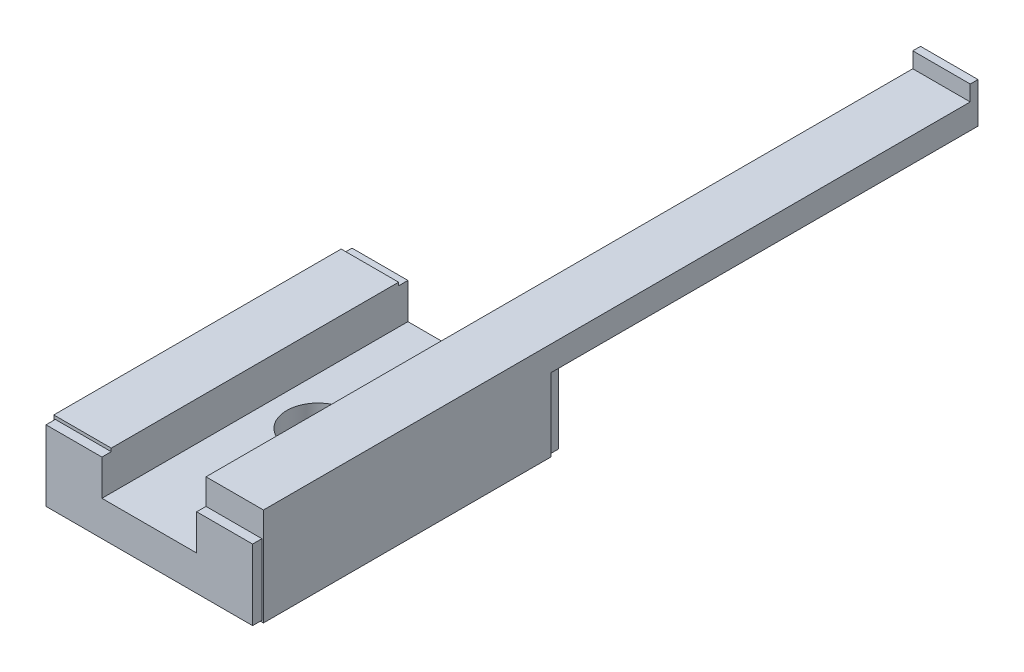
ISO-10303-21;
HEADER;
FILE_DESCRIPTION(('STEP AP214'),'2;1');
FILE_NAME('part.step','',(''),(''),'','','');
FILE_SCHEMA(('AUTOMOTIVE_DESIGN { 1 0 10303 214 1 1 1 1 }'));
ENDSEC;
DATA;
#1=APPLICATION_CONTEXT('core data for automotive mechanical design processes');
#2=APPLICATION_PROTOCOL_DEFINITION('international standard','automotive_design',2000,#1);
#3=PRODUCT_CONTEXT('',#1,'mechanical');
#4=PRODUCT('Part','Part','',(#3));
#5=PRODUCT_RELATED_PRODUCT_CATEGORY('part','',(#4));
#6=PRODUCT_DEFINITION_FORMATION('','',#4);
#7=PRODUCT_DEFINITION_CONTEXT('part definition',#1,'design');
#8=PRODUCT_DEFINITION('design','',#6,#7);
#9=PRODUCT_DEFINITION_SHAPE('','',#8);
#10=(LENGTH_UNIT() NAMED_UNIT(*) SI_UNIT(.MILLI.,.METRE.));
#11=(NAMED_UNIT(*) PLANE_ANGLE_UNIT() SI_UNIT($,.RADIAN.));
#12=(NAMED_UNIT(*) SI_UNIT($,.STERADIAN.) SOLID_ANGLE_UNIT());
#13=UNCERTAINTY_MEASURE_WITH_UNIT(LENGTH_MEASURE(1.E-05),#10,'distance_accuracy_value','');
#14=(GEOMETRIC_REPRESENTATION_CONTEXT(3) GLOBAL_UNCERTAINTY_ASSIGNED_CONTEXT((#13)) GLOBAL_UNIT_ASSIGNED_CONTEXT((#10,
#11,#12)) REPRESENTATION_CONTEXT('',''));
#15=CARTESIAN_POINT('',(0.,0.,0.));
#16=DIRECTION('',(0.,0.,1.));
#17=DIRECTION('',(1.,0.,0.));
#18=AXIS2_PLACEMENT_3D('',#15,#16,#17);
#19=CARTESIAN_POINT('',(6.1,12.6,38.2));
#20=DIRECTION('',(0.,1.,0.));
#21=DIRECTION('',(1.,0.,0.));
#22=AXIS2_PLACEMENT_3D('',#19,#20,#21);
#23=PLANE('',#22);
#24=DIRECTION('',(-1.,0.,0.));
#25=VECTOR('',#24,1.);
#26=CARTESIAN_POINT('',(13.5,12.6,-52.8));
#27=LINE('',#26,#25);
#28=CARTESIAN_POINT('',(6.1,12.6,-52.8));
#29=VERTEX_POINT('',#28);
#30=CARTESIAN_POINT('',(13.5,12.6,-52.8));
#31=VERTEX_POINT('',#30);
#32=EDGE_CURVE('E197',#29,#31,#27,.F.);
#33=ORIENTED_EDGE('',*,*,#32,.F.);
#34=DIRECTION('',(0.,0.,1.));
#35=VECTOR('',#34,1.);
#36=CARTESIAN_POINT('',(6.1,12.6,-52.8));
#37=LINE('',#36,#35);
#38=CARTESIAN_POINT('',(6.1,12.6,38.2));
#39=VERTEX_POINT('',#38);
#40=EDGE_CURVE('E212',#39,#29,#37,.F.);
#41=ORIENTED_EDGE('',*,*,#40,.F.);
#42=DIRECTION('',(1.,0.,0.));
#43=VECTOR('',#42,1.);
#44=CARTESIAN_POINT('',(6.1,12.6,38.2));
#45=LINE('',#44,#43);
#46=CARTESIAN_POINT('',(13.5,12.6,38.2));
#47=VERTEX_POINT('',#46);
#48=EDGE_CURVE('E221',#47,#39,#45,.F.);
#49=ORIENTED_EDGE('',*,*,#48,.F.);
#50=DIRECTION('',(0.,0.,-1.));
#51=VECTOR('',#50,1.);
#52=CARTESIAN_POINT('',(13.5,12.6,38.2));
#53=LINE('',#52,#51);
#54=EDGE_CURVE('E214',#47,#31,#53,.T.);
#55=ORIENTED_EDGE('',*,*,#54,.T.);
#56=EDGE_LOOP('',(#33,#41,#49,#55));
#57=FACE_BOUND('',#56,.T.);
#58=ADVANCED_FACE('F16',(#57),#23,.T.);
#59=CARTESIAN_POINT('',(-13.5,9.7,38.2));
#60=DIRECTION('',(0.,1.,0.));
#61=DIRECTION('',(1.,0.,0.));
#62=AXIS2_PLACEMENT_3D('',#59,#60,#61);
#63=PLANE('',#62);
#64=DIRECTION('',(1.,0.,0.));
#65=VECTOR('',#64,1.);
#66=CARTESIAN_POINT('',(-13.5,9.7,38.2));
#67=LINE('',#66,#65);
#68=CARTESIAN_POINT('',(-6.1,9.7,38.2));
#69=VERTEX_POINT('',#68);
#70=CARTESIAN_POINT('',(-13.5,9.7,38.2));
#71=VERTEX_POINT('',#70);
#72=EDGE_CURVE('E232',#69,#71,#67,.F.);
#73=ORIENTED_EDGE('',*,*,#72,.F.);
#74=DIRECTION('',(0.,0.,-1.));
#75=VECTOR('',#74,1.);
#76=CARTESIAN_POINT('',(-6.1,9.7,38.2));
#77=LINE('',#76,#75);
#78=CARTESIAN_POINT('',(-6.1,9.7,1.2));
#79=VERTEX_POINT('',#78);
#80=EDGE_CURVE('E236',#69,#79,#77,.T.);
#81=ORIENTED_EDGE('',*,*,#80,.T.);
#82=DIRECTION('',(-1.,0.,0.));
#83=VECTOR('',#82,1.);
#84=CARTESIAN_POINT('',(-6.1,9.7,1.2));
#85=LINE('',#84,#83);
#86=CARTESIAN_POINT('',(-13.5,9.7,1.2));
#87=VERTEX_POINT('',#86);
#88=EDGE_CURVE('E241',#79,#87,#85,.T.);
#89=ORIENTED_EDGE('',*,*,#88,.T.);
#90=DIRECTION('',(0.,0.,1.));
#91=VECTOR('',#90,1.);
#92=CARTESIAN_POINT('',(-13.5,9.7,1.2));
#93=LINE('',#92,#91);
#94=EDGE_CURVE('E246',#71,#87,#93,.F.);
#95=ORIENTED_EDGE('',*,*,#94,.F.);
#96=EDGE_LOOP('',(#73,#81,#89,#95));
#97=FACE_BOUND('',#96,.T.);
#98=ADVANCED_FACE('F638',(#97),#63,.T.);
#99=CARTESIAN_POINT('',(-13.5,0.,38.2));
#100=DIRECTION('',(-1.,0.,0.));
#101=DIRECTION('',(0.,1.,0.));
#102=AXIS2_PLACEMENT_3D('',#99,#100,#101);
#103=PLANE('',#102);
#104=DIRECTION('',(0.,1.,0.));
#105=VECTOR('',#104,1.);
#106=CARTESIAN_POINT('',(-13.5,0.,38.2));
#107=LINE('',#106,#105);
#108=CARTESIAN_POINT('',(-13.5,0.,38.2));
#109=VERTEX_POINT('',#108);
#110=EDGE_CURVE('E251',#71,#109,#107,.F.);
#111=ORIENTED_EDGE('',*,*,#110,.F.);
#112=ORIENTED_EDGE('',*,*,#94,.T.);
#113=DIRECTION('',(0.,-1.,0.));
#114=VECTOR('',#113,1.);
#115=CARTESIAN_POINT('',(-13.5,9.7,1.2));
#116=LINE('',#115,#114);
#117=CARTESIAN_POINT('',(-13.5,0.,1.2));
#118=VERTEX_POINT('',#117);
#119=EDGE_CURVE('E255',#87,#118,#116,.T.);
#120=ORIENTED_EDGE('',*,*,#119,.T.);
#121=DIRECTION('',(0.,0.,1.));
#122=VECTOR('',#121,1.);
#123=CARTESIAN_POINT('',(-13.5,0.,1.2));
#124=LINE('',#123,#122);
#125=EDGE_CURVE('E260',#109,#118,#124,.F.);
#126=ORIENTED_EDGE('',*,*,#125,.F.);
#127=EDGE_LOOP('',(#111,#112,#120,#126));
#128=FACE_BOUND('',#127,.T.);
#129=ADVANCED_FACE('F643',(#128),#103,.T.);
#130=CARTESIAN_POINT('',(-13.5,0.,1.2));
#131=DIRECTION('',(0.,-1.,0.));
#132=DIRECTION('',(1.,0.,0.));
#133=AXIS2_PLACEMENT_3D('',#130,#131,#132);
#134=PLANE('',#133);
#135=DIRECTION('',(-1.,0.,0.));
#136=VECTOR('',#135,1.);
#137=CARTESIAN_POINT('',(-6.4,0.,38.2));
#138=LINE('',#137,#136);
#139=CARTESIAN_POINT('',(-6.4,0.,38.2));
#140=VERTEX_POINT('',#139);
#141=EDGE_CURVE('E265',#109,#140,#138,.F.);
#142=ORIENTED_EDGE('',*,*,#141,.F.);
#143=ORIENTED_EDGE('',*,*,#125,.T.);
#144=DIRECTION('',(1.,0.,0.));
#145=VECTOR('',#144,1.);
#146=CARTESIAN_POINT('',(-13.5,0.,1.2));
#147=LINE('',#146,#145);
#148=CARTESIAN_POINT('',(-6.4,0.,1.2));
#149=VERTEX_POINT('',#148);
#150=EDGE_CURVE('E269',#118,#149,#147,.T.);
#151=ORIENTED_EDGE('',*,*,#150,.T.);
#152=DIRECTION('',(0.,0.,1.));
#153=VECTOR('',#152,1.);
#154=CARTESIAN_POINT('',(-6.4,0.,1.2));
#155=LINE('',#154,#153);
#156=EDGE_CURVE('E274',#140,#149,#155,.F.);
#157=ORIENTED_EDGE('',*,*,#156,.F.);
#158=EDGE_LOOP('',(#142,#143,#151,#157));
#159=FACE_BOUND('',#158,.T.);
#160=CARTESIAN_POINT('',(-10.,0.,6.7));
#161=DIRECTION('',(0.,1.,0.));
#162=DIRECTION('',(0.,0.,-1.));
#163=AXIS2_PLACEMENT_3D('',#160,#161,#162);
#164=CIRCLE('',#163,2.);
#165=CARTESIAN_POINT('',(-10.,0.,4.7));
#166=VERTEX_POINT('',#165);
#167=EDGE_CURVE('E279',#166,#166,#164,.F.);
#168=ORIENTED_EDGE('',*,*,#167,.F.);
#169=EDGE_LOOP('',(#168));
#170=FACE_BOUND('',#169,.T.);
#171=CARTESIAN_POINT('',(-10.,0.,32.7));
#172=DIRECTION('',(0.,1.,0.));
#173=DIRECTION('',(0.,0.,-1.));
#174=AXIS2_PLACEMENT_3D('',#171,#172,#173);
#175=CIRCLE('',#174,2.);
#176=CARTESIAN_POINT('',(-10.,0.,30.7));
#177=VERTEX_POINT('',#176);
#178=EDGE_CURVE('E284',#177,#177,#175,.F.);
#179=ORIENTED_EDGE('',*,*,#178,.F.);
#180=EDGE_LOOP('',(#179));
#181=FACE_BOUND('',#180,.T.);
#182=ADVANCED_FACE('F649',(#159,#170,#181),#134,.T.);
#183=CARTESIAN_POINT('',(-6.2,0.200000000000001,1.2));
#184=DIRECTION('',(0.707106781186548,-0.707106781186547,0.));
#185=DIRECTION('',(0.,0.,1.));
#186=AXIS2_PLACEMENT_3D('',#183,#184,#185);
#187=PLANE('',#186);
#188=DIRECTION('',(-0.707106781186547,-0.707106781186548,0.));
#189=VECTOR('',#188,1.);
#190=CARTESIAN_POINT('',(-6.2,0.200000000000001,38.2));
#191=LINE('',#190,#189);
#192=CARTESIAN_POINT('',(-6.2,0.200000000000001,38.2));
#193=VERTEX_POINT('',#192);
#194=EDGE_CURVE('E287',#140,#193,#191,.F.);
#195=ORIENTED_EDGE('',*,*,#194,.F.);
#196=ORIENTED_EDGE('',*,*,#156,.T.);
#197=DIRECTION('',(0.707106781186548,0.707106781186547,0.));
#198=VECTOR('',#197,1.);
#199=CARTESIAN_POINT('',(-6.4,0.,1.2));
#200=LINE('',#199,#198);
#201=CARTESIAN_POINT('',(-6.2,0.200000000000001,1.2));
#202=VERTEX_POINT('',#201);
#203=EDGE_CURVE('E289',#149,#202,#200,.T.);
#204=ORIENTED_EDGE('',*,*,#203,.T.);
#205=DIRECTION('',(0.,0.,1.));
#206=VECTOR('',#205,1.);
#207=CARTESIAN_POINT('',(-6.2,0.2,1.2));
#208=LINE('',#207,#206);
#209=EDGE_CURVE('E294',#193,#202,#208,.F.);
#210=ORIENTED_EDGE('',*,*,#209,.F.);
#211=EDGE_LOOP('',(#195,#196,#204,#210));
#212=FACE_BOUND('',#211,.T.);
#213=ADVANCED_FACE('F653',(#212),#187,.T.);
#214=CARTESIAN_POINT('',(6.4,0.,1.2));
#215=DIRECTION('',(-0.707106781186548,-0.707106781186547,0.));
#216=DIRECTION('',(0.,0.,1.));
#217=AXIS2_PLACEMENT_3D('',#214,#215,#216);
#218=PLANE('',#217);
#219=DIRECTION('',(-0.707106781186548,0.707106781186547,0.));
#220=VECTOR('',#219,1.);
#221=CARTESIAN_POINT('',(6.4,0.,38.2));
#222=LINE('',#221,#220);
#223=CARTESIAN_POINT('',(6.2,0.2,38.2));
#224=VERTEX_POINT('',#223);
#225=CARTESIAN_POINT('',(6.4,0.,38.2));
#226=VERTEX_POINT('',#225);
#227=EDGE_CURVE('E299',#224,#226,#222,.F.);
#228=ORIENTED_EDGE('',*,*,#227,.F.);
#229=DIRECTION('',(0.,0.,-1.));
#230=VECTOR('',#229,1.);
#231=CARTESIAN_POINT('',(6.2,0.2,38.2));
#232=LINE('',#231,#230);
#233=CARTESIAN_POINT('',(6.2,0.199999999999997,1.2));
#234=VERTEX_POINT('',#233);
#235=EDGE_CURVE('E303',#224,#234,#232,.T.);
#236=ORIENTED_EDGE('',*,*,#235,.T.);
#237=DIRECTION('',(0.707106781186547,-0.707106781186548,0.));
#238=VECTOR('',#237,1.);
#239=CARTESIAN_POINT('',(6.2,0.199999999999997,1.2));
#240=LINE('',#239,#238);
#241=CARTESIAN_POINT('',(6.4,0.,1.2));
#242=VERTEX_POINT('',#241);
#243=EDGE_CURVE('E308',#234,#242,#240,.T.);
#244=ORIENTED_EDGE('',*,*,#243,.T.);
#245=DIRECTION('',(0.,0.,1.));
#246=VECTOR('',#245,1.);
#247=CARTESIAN_POINT('',(6.4,0.,1.2));
#248=LINE('',#247,#246);
#249=EDGE_CURVE('E313',#226,#242,#248,.F.);
#250=ORIENTED_EDGE('',*,*,#249,.F.);
#251=EDGE_LOOP('',(#228,#236,#244,#250));
#252=FACE_BOUND('',#251,.T.);
#253=ADVANCED_FACE('F657',(#252),#218,.T.);
#254=CARTESIAN_POINT('',(6.4,0.,1.2));
#255=DIRECTION('',(0.,-1.,0.));
#256=DIRECTION('',(1.,0.,0.));
#257=AXIS2_PLACEMENT_3D('',#254,#255,#256);
#258=PLANE('',#257);
#259=DIRECTION('',(-1.,0.,0.));
#260=VECTOR('',#259,1.);
#261=CARTESIAN_POINT('',(13.5,0.,38.2));
#262=LINE('',#261,#260);
#263=CARTESIAN_POINT('',(13.5,0.,38.2));
#264=VERTEX_POINT('',#263);
#265=EDGE_CURVE('E318',#226,#264,#262,.F.);
#266=ORIENTED_EDGE('',*,*,#265,.F.);
#267=ORIENTED_EDGE('',*,*,#249,.T.);
#268=DIRECTION('',(1.,0.,0.));
#269=VECTOR('',#268,1.);
#270=CARTESIAN_POINT('',(6.4,0.,1.2));
#271=LINE('',#270,#269);
#272=CARTESIAN_POINT('',(13.5,0.,1.2));
#273=VERTEX_POINT('',#272);
#274=EDGE_CURVE('E322',#242,#273,#271,.T.);
#275=ORIENTED_EDGE('',*,*,#274,.T.);
#276=DIRECTION('',(0.,0.,1.));
#277=VECTOR('',#276,1.);
#278=CARTESIAN_POINT('',(13.5,0.,1.2));
#279=LINE('',#278,#277);
#280=EDGE_CURVE('E327',#264,#273,#279,.F.);
#281=ORIENTED_EDGE('',*,*,#280,.F.);
#282=EDGE_LOOP('',(#266,#267,#275,#281));
#283=FACE_BOUND('',#282,.T.);
#284=CARTESIAN_POINT('',(10.,0.,6.7));
#285=DIRECTION('',(0.,1.,0.));
#286=DIRECTION('',(0.,0.,-1.));
#287=AXIS2_PLACEMENT_3D('',#284,#285,#286);
#288=CIRCLE('',#287,2.);
#289=CARTESIAN_POINT('',(10.,0.,4.7));
#290=VERTEX_POINT('',#289);
#291=EDGE_CURVE('E332',#290,#290,#288,.F.);
#292=ORIENTED_EDGE('',*,*,#291,.F.);
#293=EDGE_LOOP('',(#292));
#294=FACE_BOUND('',#293,.T.);
#295=CARTESIAN_POINT('',(10.,0.,32.7));
#296=DIRECTION('',(0.,1.,0.));
#297=DIRECTION('',(0.,0.,-1.));
#298=AXIS2_PLACEMENT_3D('',#295,#296,#297);
#299=CIRCLE('',#298,2.);
#300=CARTESIAN_POINT('',(10.,0.,30.7));
#301=VERTEX_POINT('',#300);
#302=EDGE_CURVE('E337',#301,#301,#299,.F.);
#303=ORIENTED_EDGE('',*,*,#302,.F.);
#304=EDGE_LOOP('',(#303));
#305=FACE_BOUND('',#304,.T.);
#306=ADVANCED_FACE('F661',(#283,#294,#305),#258,.T.);
#307=CARTESIAN_POINT('',(13.5,0.,-53.8));
#308=DIRECTION('',(1.,0.,0.));
#309=DIRECTION('',(0.,1.,0.));
#310=AXIS2_PLACEMENT_3D('',#307,#308,#309);
#311=PLANE('',#310);
#312=DIRECTION('',(0.,-1.,0.));
#313=VECTOR('',#312,1.);
#314=CARTESIAN_POINT('',(13.5,12.6,38.2));
#315=LINE('',#314,#313);
#316=EDGE_CURVE('E340',#264,#47,#315,.F.);
#317=ORIENTED_EDGE('',*,*,#316,.F.);
#318=ORIENTED_EDGE('',*,*,#280,.T.);
#319=DIRECTION('',(0.,1.,0.));
#320=VECTOR('',#319,1.);
#321=CARTESIAN_POINT('',(13.5,0.,1.2));
#322=LINE('',#321,#320);
#323=CARTESIAN_POINT('',(13.5,9.4,1.2));
#324=VERTEX_POINT('',#323);
#325=EDGE_CURVE('E342',#273,#324,#322,.T.);
#326=ORIENTED_EDGE('',*,*,#325,.T.);
#327=DIRECTION('',(0.,0.,-1.));
#328=VECTOR('',#327,1.);
#329=CARTESIAN_POINT('',(13.5,9.4,1.2));
#330=LINE('',#329,#328);
#331=CARTESIAN_POINT('',(13.5,9.4,-53.8));
#332=VERTEX_POINT('',#331);
#333=EDGE_CURVE('E347',#332,#324,#330,.F.);
#334=ORIENTED_EDGE('',*,*,#333,.F.);
#335=DIRECTION('',(0.,1.,0.));
#336=VECTOR('',#335,1.);
#337=CARTESIAN_POINT('',(13.5,9.4,-53.8));
#338=LINE('',#337,#336);
#339=CARTESIAN_POINT('',(13.5,14.6,-53.8));
#340=VERTEX_POINT('',#339);
#341=EDGE_CURVE('E351',#332,#340,#338,.T.);
#342=ORIENTED_EDGE('',*,*,#341,.T.);
#343=DIRECTION('',(0.,0.,1.));
#344=VECTOR('',#343,1.);
#345=CARTESIAN_POINT('',(13.5,14.6,-53.8));
#346=LINE('',#345,#344);
#347=CARTESIAN_POINT('',(13.5,14.6,-52.8));
#348=VERTEX_POINT('',#347);
#349=EDGE_CURVE('E356',#348,#340,#346,.F.);
#350=ORIENTED_EDGE('',*,*,#349,.F.);
#351=DIRECTION('',(0.,-1.,0.));
#352=VECTOR('',#351,1.);
#353=CARTESIAN_POINT('',(13.5,14.6,-52.8));
#354=LINE('',#353,#352);
#355=EDGE_CURVE('E360',#31,#348,#354,.F.);
#356=ORIENTED_EDGE('',*,*,#355,.F.);
#357=ORIENTED_EDGE('',*,*,#54,.F.);
#358=EDGE_LOOP('',(#317,#318,#326,#334,#342,#350,#356,#357));
#359=FACE_BOUND('',#358,.T.);
#360=ADVANCED_FACE('F665',(#359),#311,.T.);
#361=CARTESIAN_POINT('',(6.1,4.7,39.4));
#362=DIRECTION('',(-1.,0.,0.));
#363=DIRECTION('',(0.,1.,0.));
#364=AXIS2_PLACEMENT_3D('',#361,#362,#363);
#365=PLANE('',#364);
#366=DIRECTION('',(0.,0.,1.));
#367=VECTOR('',#366,1.);
#368=CARTESIAN_POINT('',(6.1,9.4,-53.8));
#369=LINE('',#368,#367);
#370=CARTESIAN_POINT('',(6.1,9.4,-53.8));
#371=VERTEX_POINT('',#370);
#372=CARTESIAN_POINT('',(6.1,9.4,0.));
#373=VERTEX_POINT('',#372);
#374=EDGE_CURVE('E364',#371,#373,#369,.T.);
#375=ORIENTED_EDGE('',*,*,#374,.T.);
#376=DIRECTION('',(0.,-1.,0.));
#377=VECTOR('',#376,1.);
#378=CARTESIAN_POINT('',(6.1,9.4,0.));
#379=LINE('',#378,#377);
#380=CARTESIAN_POINT('',(6.1,4.7,0.));
#381=VERTEX_POINT('',#380);
#382=EDGE_CURVE('E368',#373,#381,#379,.T.);
#383=ORIENTED_EDGE('',*,*,#382,.T.);
#384=DIRECTION('',(0.,0.,1.));
#385=VECTOR('',#384,1.);
#386=CARTESIAN_POINT('',(6.1,4.7,0.));
#387=LINE('',#386,#385);
#388=CARTESIAN_POINT('',(6.1,4.7,39.4));
#389=VERTEX_POINT('',#388);
#390=EDGE_CURVE('E373',#389,#381,#387,.F.);
#391=ORIENTED_EDGE('',*,*,#390,.F.);
#392=DIRECTION('',(0.,1.,0.));
#393=VECTOR('',#392,1.);
#394=CARTESIAN_POINT('',(6.1,4.7,39.4));
#395=LINE('',#394,#393);
#396=CARTESIAN_POINT('',(6.1,9.3,39.4));
#397=VERTEX_POINT('',#396);
#398=EDGE_CURVE('E377',#397,#389,#395,.F.);
#399=ORIENTED_EDGE('',*,*,#398,.F.);
#400=DIRECTION('',(0.,0.,-1.));
#401=VECTOR('',#400,1.);
#402=CARTESIAN_POINT('',(6.1,9.3,39.4));
#403=LINE('',#402,#401);
#404=CARTESIAN_POINT('',(6.1,9.3,38.2));
#405=VERTEX_POINT('',#404);
#406=EDGE_CURVE('E381',#405,#397,#403,.F.);
#407=ORIENTED_EDGE('',*,*,#406,.F.);
#408=DIRECTION('',(0.,1.,0.));
#409=VECTOR('',#408,1.);
#410=CARTESIAN_POINT('',(6.1,9.3,38.2));
#411=LINE('',#410,#409);
#412=EDGE_CURVE('E206',#39,#405,#411,.F.);
#413=ORIENTED_EDGE('',*,*,#412,.F.);
#414=ORIENTED_EDGE('',*,*,#40,.T.);
#415=DIRECTION('',(0.,1.,0.));
#416=VECTOR('',#415,1.);
#417=CARTESIAN_POINT('',(6.1,12.6,-52.8));
#418=LINE('',#417,#416);
#419=CARTESIAN_POINT('',(6.1,14.6,-52.8));
#420=VERTEX_POINT('',#419);
#421=EDGE_CURVE('E194',#420,#29,#418,.F.);
#422=ORIENTED_EDGE('',*,*,#421,.F.);
#423=DIRECTION('',(0.,0.,-1.));
#424=VECTOR('',#423,1.);
#425=CARTESIAN_POINT('',(6.1,14.6,-52.8));
#426=LINE('',#425,#424);
#427=CARTESIAN_POINT('',(6.1,14.6,-53.8));
#428=VERTEX_POINT('',#427);
#429=EDGE_CURVE('E205',#420,#428,#426,.T.);
#430=ORIENTED_EDGE('',*,*,#429,.T.);
#431=DIRECTION('',(0.,-1.,0.));
#432=VECTOR('',#431,1.);
#433=CARTESIAN_POINT('',(6.1,14.6,-53.8));
#434=LINE('',#433,#432);
#435=EDGE_CURVE('E393',#428,#371,#434,.T.);
#436=ORIENTED_EDGE('',*,*,#435,.T.);
#437=EDGE_LOOP('',(#375,#383,#391,#399,#407,#413,#414,#422,#430,#436));
#438=FACE_BOUND('',#437,.T.);
#439=ADVANCED_FACE('F218',(#438),#365,.T.);
#440=CARTESIAN_POINT('',(-6.1,4.7,0.));
#441=DIRECTION('',(1.,0.,0.));
#442=DIRECTION('',(0.,1.,0.));
#443=AXIS2_PLACEMENT_3D('',#440,#441,#442);
#444=PLANE('',#443);
#445=DIRECTION('',(0.,-1.,0.));
#446=VECTOR('',#445,1.);
#447=CARTESIAN_POINT('',(-6.1,9.7,38.2));
#448=LINE('',#447,#446);
#449=CARTESIAN_POINT('',(-6.1,9.3,38.2));
#450=VERTEX_POINT('',#449);
#451=EDGE_CURVE('E398',#450,#69,#448,.F.);
#452=ORIENTED_EDGE('',*,*,#451,.F.);
#453=DIRECTION('',(0.,0.,1.));
#454=VECTOR('',#453,1.);
#455=CARTESIAN_POINT('',(-6.1,9.3,38.2));
#456=LINE('',#455,#454);
#457=CARTESIAN_POINT('',(-6.1,9.3,39.4));
#458=VERTEX_POINT('',#457);
#459=EDGE_CURVE('E402',#450,#458,#456,.T.);
#460=ORIENTED_EDGE('',*,*,#459,.T.);
#461=DIRECTION('',(0.,-1.,0.));
#462=VECTOR('',#461,1.);
#463=CARTESIAN_POINT('',(-6.1,9.3,39.4));
#464=LINE('',#463,#462);
#465=CARTESIAN_POINT('',(-6.1,4.7,39.4));
#466=VERTEX_POINT('',#465);
#467=EDGE_CURVE('E407',#466,#458,#464,.F.);
#468=ORIENTED_EDGE('',*,*,#467,.F.);
#469=DIRECTION('',(0.,0.,-1.));
#470=VECTOR('',#469,1.);
#471=CARTESIAN_POINT('',(-6.1,4.7,39.4));
#472=LINE('',#471,#470);
#473=CARTESIAN_POINT('',(-6.1,4.7,0.));
#474=VERTEX_POINT('',#473);
#475=EDGE_CURVE('E412',#466,#474,#472,.T.);
#476=ORIENTED_EDGE('',*,*,#475,.T.);
#477=DIRECTION('',(0.,1.,0.));
#478=VECTOR('',#477,1.);
#479=CARTESIAN_POINT('',(-6.1,4.7,0.));
#480=LINE('',#479,#478);
#481=CARTESIAN_POINT('',(-6.1,9.3,0.));
#482=VERTEX_POINT('',#481);
#483=EDGE_CURVE('E417',#474,#482,#480,.T.);
#484=ORIENTED_EDGE('',*,*,#483,.T.);
#485=DIRECTION('',(0.,0.,1.));
#486=VECTOR('',#485,1.);
#487=CARTESIAN_POINT('',(-6.1,9.3,0.));
#488=LINE('',#487,#486);
#489=CARTESIAN_POINT('',(-6.1,9.3,1.2));
#490=VERTEX_POINT('',#489);
#491=EDGE_CURVE('E422',#490,#482,#488,.F.);
#492=ORIENTED_EDGE('',*,*,#491,.F.);
#493=DIRECTION('',(0.,1.,0.));
#494=VECTOR('',#493,1.);
#495=CARTESIAN_POINT('',(-6.1,9.3,1.2));
#496=LINE('',#495,#494);
#497=EDGE_CURVE('E426',#490,#79,#496,.T.);
#498=ORIENTED_EDGE('',*,*,#497,.T.);
#499=ORIENTED_EDGE('',*,*,#80,.F.);
#500=EDGE_LOOP('',(#452,#460,#468,#476,#484,#492,#498,#499));
#501=FACE_BOUND('',#500,.T.);
#502=ADVANCED_FACE('F672',(#501),#444,.T.);
#503=CARTESIAN_POINT('',(-13.3,0.199999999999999,0.));
#504=DIRECTION('',(0.,0.,-1.));
#505=DIRECTION('',(0.,1.,0.));
#506=AXIS2_PLACEMENT_3D('',#503,#504,#505);
#507=PLANE('',#506);
#508=ORIENTED_EDGE('',*,*,#382,.F.);
#509=DIRECTION('',(1.,0.,0.));
#510=VECTOR('',#509,1.);
#511=CARTESIAN_POINT('',(6.1,9.4,0.));
#512=LINE('',#511,#510);
#513=CARTESIAN_POINT('',(13.3,9.4,0.));
#514=VERTEX_POINT('',#513);
#515=EDGE_CURVE('E431',#373,#514,#512,.T.);
#516=ORIENTED_EDGE('',*,*,#515,.T.);
#517=DIRECTION('',(0.,-1.,0.));
#518=VECTOR('',#517,1.);
#519=CARTESIAN_POINT('',(13.3,9.4,0.));
#520=LINE('',#519,#518);
#521=CARTESIAN_POINT('',(13.3,0.199999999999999,0.));
#522=VERTEX_POINT('',#521);
#523=EDGE_CURVE('E436',#514,#522,#520,.T.);
#524=ORIENTED_EDGE('',*,*,#523,.T.);
#525=DIRECTION('',(-1.,0.,0.));
#526=VECTOR('',#525,1.);
#527=CARTESIAN_POINT('',(13.3,0.2,0.));
#528=LINE('',#527,#526);
#529=CARTESIAN_POINT('',(-13.3,0.2,0.));
#530=VERTEX_POINT('',#529);
#531=EDGE_CURVE('E441',#530,#522,#528,.F.);
#532=ORIENTED_EDGE('',*,*,#531,.F.);
#533=DIRECTION('',(0.,1.,0.));
#534=VECTOR('',#533,1.);
#535=CARTESIAN_POINT('',(-13.3,0.2,0.));
#536=LINE('',#535,#534);
#537=CARTESIAN_POINT('',(-13.3,9.3,0.));
#538=VERTEX_POINT('',#537);
#539=EDGE_CURVE('E446',#530,#538,#536,.T.);
#540=ORIENTED_EDGE('',*,*,#539,.T.);
#541=DIRECTION('',(1.,0.,0.));
#542=VECTOR('',#541,1.);
#543=CARTESIAN_POINT('',(-13.3,9.3,0.));
#544=LINE('',#543,#542);
#545=EDGE_CURVE('E451',#538,#482,#544,.T.);
#546=ORIENTED_EDGE('',*,*,#545,.T.);
#547=ORIENTED_EDGE('',*,*,#483,.F.);
#548=DIRECTION('',(1.,0.,0.));
#549=VECTOR('',#548,1.);
#550=CARTESIAN_POINT('',(-6.1,4.7,0.));
#551=LINE('',#550,#549);
#552=EDGE_CURVE('E456',#381,#474,#551,.F.);
#553=ORIENTED_EDGE('',*,*,#552,.F.);
#554=EDGE_LOOP('',(#508,#516,#524,#532,#540,#546,#547,#553));
#555=FACE_BOUND('',#554,.T.);
#556=ADVANCED_FACE('F675',(#555),#507,.T.);
#557=CARTESIAN_POINT('',(-13.3,0.2,0.));
#558=DIRECTION('',(0.,-1.,0.));
#559=DIRECTION('',(1.,0.,0.));
#560=AXIS2_PLACEMENT_3D('',#557,#558,#559);
#561=PLANE('',#560);
#562=DIRECTION('',(-1.,0.,0.));
#563=VECTOR('',#562,1.);
#564=CARTESIAN_POINT('',(13.3,0.2,39.4));
#565=LINE('',#564,#563);
#566=CARTESIAN_POINT('',(-13.3,0.2,39.4));
#567=VERTEX_POINT('',#566);
#568=CARTESIAN_POINT('',(13.3,0.2,39.4));
#569=VERTEX_POINT('',#568);
#570=EDGE_CURVE('E460',#567,#569,#565,.F.);
#571=ORIENTED_EDGE('',*,*,#570,.F.);
#572=DIRECTION('',(0.,0.,-1.));
#573=VECTOR('',#572,1.);
#574=CARTESIAN_POINT('',(-13.3,0.2,39.4));
#575=LINE('',#574,#573);
#576=CARTESIAN_POINT('',(-13.3,0.2,38.2));
#577=VERTEX_POINT('',#576);
#578=EDGE_CURVE('E465',#577,#567,#575,.F.);
#579=ORIENTED_EDGE('',*,*,#578,.F.);
#580=DIRECTION('',(1.,0.,0.));
#581=VECTOR('',#580,1.);
#582=CARTESIAN_POINT('',(-13.3,0.2,38.2));
#583=LINE('',#582,#581);
#584=EDGE_CURVE('E469',#193,#577,#583,.F.);
#585=ORIENTED_EDGE('',*,*,#584,.F.);
#586=ORIENTED_EDGE('',*,*,#209,.T.);
#587=DIRECTION('',(-1.,0.,0.));
#588=VECTOR('',#587,1.);
#589=CARTESIAN_POINT('',(-6.2,0.2,1.2));
#590=LINE('',#589,#588);
#591=CARTESIAN_POINT('',(-13.3,0.2,1.2));
#592=VERTEX_POINT('',#591);
#593=EDGE_CURVE('E473',#202,#592,#590,.T.);
#594=ORIENTED_EDGE('',*,*,#593,.T.);
#595=DIRECTION('',(0.,0.,-1.));
#596=VECTOR('',#595,1.);
#597=CARTESIAN_POINT('',(-13.3,0.2,1.2));
#598=LINE('',#597,#596);
#599=EDGE_CURVE('E478',#592,#530,#598,.T.);
#600=ORIENTED_EDGE('',*,*,#599,.T.);
#601=ORIENTED_EDGE('',*,*,#531,.T.);
#602=DIRECTION('',(0.,0.,1.));
#603=VECTOR('',#602,1.);
#604=CARTESIAN_POINT('',(13.3,0.2,0.));
#605=LINE('',#604,#603);
#606=CARTESIAN_POINT('',(13.3,0.2,1.2));
#607=VERTEX_POINT('',#606);
#608=EDGE_CURVE('E483',#607,#522,#605,.F.);
#609=ORIENTED_EDGE('',*,*,#608,.F.);
#610=DIRECTION('',(-1.,0.,0.));
#611=VECTOR('',#610,1.);
#612=CARTESIAN_POINT('',(13.3,0.2,1.2));
#613=LINE('',#612,#611);
#614=EDGE_CURVE('E487',#607,#234,#613,.T.);
#615=ORIENTED_EDGE('',*,*,#614,.T.);
#616=ORIENTED_EDGE('',*,*,#235,.F.);
#617=DIRECTION('',(1.,0.,0.));
#618=VECTOR('',#617,1.);
#619=CARTESIAN_POINT('',(6.20000000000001,0.2,38.2));
#620=LINE('',#619,#618);
#621=CARTESIAN_POINT('',(13.3,0.2,38.2));
#622=VERTEX_POINT('',#621);
#623=EDGE_CURVE('E492',#622,#224,#620,.F.);
#624=ORIENTED_EDGE('',*,*,#623,.F.);
#625=DIRECTION('',(0.,0.,1.));
#626=VECTOR('',#625,1.);
#627=CARTESIAN_POINT('',(13.3,0.2,38.2));
#628=LINE('',#627,#626);
#629=EDGE_CURVE('E496',#622,#569,#628,.T.);
#630=ORIENTED_EDGE('',*,*,#629,.T.);
#631=EDGE_LOOP('',(#571,#579,#585,#586,#594,#600,#601,#609,#615,#616,#624,#630));
#632=FACE_BOUND('',#631,.T.);
#633=CARTESIAN_POINT('',(0.,0.2,17.7));
#634=DIRECTION('',(0.,1.,0.));
#635=DIRECTION('',(-1.42053960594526E-07,0.,-0.99999999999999));
#636=AXIS2_PLACEMENT_3D('',#633,#634,#635);
#637=CIRCLE('',#636,4.);
#638=CARTESIAN_POINT('',(-5.68215842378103E-07,0.2,13.7));
#639=VERTEX_POINT('',#638);
#640=EDGE_CURVE('E501',#639,#639,#637,.F.);
#641=ORIENTED_EDGE('',*,*,#640,.F.);
#642=EDGE_LOOP('',(#641));
#643=FACE_BOUND('',#642,.T.);
#644=CARTESIAN_POINT('',(0.,0.2,32.7));
#645=DIRECTION('',(0.,1.,0.));
#646=DIRECTION('',(-1.4205399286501E-07,0.,-0.99999999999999));
#647=AXIS2_PLACEMENT_3D('',#644,#645,#646);
#648=CIRCLE('',#647,1.5);
#649=CARTESIAN_POINT('',(-2.13080989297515E-07,0.2,31.2));
#650=VERTEX_POINT('',#649);
#651=EDGE_CURVE('E506',#650,#650,#648,.F.);
#652=ORIENTED_EDGE('',*,*,#651,.F.);
#653=EDGE_LOOP('',(#652));
#654=FACE_BOUND('',#653,.T.);
#655=ADVANCED_FACE('F679',(#632,#643,#654),#561,.T.);
#656=CARTESIAN_POINT('',(-6.1,4.7,39.4));
#657=DIRECTION('',(0.,1.,0.));
#658=DIRECTION('',(1.,0.,0.));
#659=AXIS2_PLACEMENT_3D('',#656,#657,#658);
#660=PLANE('',#659);
#661=ORIENTED_EDGE('',*,*,#552,.T.);
#662=ORIENTED_EDGE('',*,*,#475,.F.);
#663=DIRECTION('',(1.,0.,0.));
#664=VECTOR('',#663,1.);
#665=CARTESIAN_POINT('',(-6.1,4.7,39.4));
#666=LINE('',#665,#664);
#667=EDGE_CURVE('E509',#389,#466,#666,.F.);
#668=ORIENTED_EDGE('',*,*,#667,.F.);
#669=ORIENTED_EDGE('',*,*,#390,.T.);
#670=EDGE_LOOP('',(#661,#662,#668,#669));
#671=FACE_BOUND('',#670,.T.);
#672=CARTESIAN_POINT('',(0.,4.7,17.7));
#673=DIRECTION('',(0.,-1.,0.));
#674=DIRECTION('',(-1.42053860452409E-07,0.,0.99999999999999));
#675=AXIS2_PLACEMENT_3D('',#672,#673,#674);
#676=CIRCLE('',#675,4.);
#677=CARTESIAN_POINT('',(-5.68215441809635E-07,4.7,21.7));
#678=VERTEX_POINT('',#677);
#679=EDGE_CURVE('E511',#678,#678,#676,.F.);
#680=ORIENTED_EDGE('',*,*,#679,.F.);
#681=EDGE_LOOP('',(#680));
#682=FACE_BOUND('',#681,.T.);
#683=ADVANCED_FACE('F683',(#671,#682),#660,.T.);
#684=CARTESIAN_POINT('',(-13.3,0.199999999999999,39.4));
#685=DIRECTION('',(0.,0.,1.));
#686=DIRECTION('',(1.,0.,0.));
#687=AXIS2_PLACEMENT_3D('',#684,#685,#686);
#688=PLANE('',#687);
#689=DIRECTION('',(-1.,0.,0.));
#690=VECTOR('',#689,1.);
#691=CARTESIAN_POINT('',(13.3,9.3,39.4));
#692=LINE('',#691,#690);
#693=CARTESIAN_POINT('',(13.3,9.3,39.4));
#694=VERTEX_POINT('',#693);
#695=EDGE_CURVE('E516',#397,#694,#692,.F.);
#696=ORIENTED_EDGE('',*,*,#695,.F.);
#697=ORIENTED_EDGE('',*,*,#398,.T.);
#698=ORIENTED_EDGE('',*,*,#667,.T.);
#699=ORIENTED_EDGE('',*,*,#467,.T.);
#700=DIRECTION('',(-1.,0.,0.));
#701=VECTOR('',#700,1.);
#702=CARTESIAN_POINT('',(-6.1,9.3,39.4));
#703=LINE('',#702,#701);
#704=CARTESIAN_POINT('',(-13.3,9.3,39.4));
#705=VERTEX_POINT('',#704);
#706=EDGE_CURVE('E519',#705,#458,#703,.F.);
#707=ORIENTED_EDGE('',*,*,#706,.F.);
#708=DIRECTION('',(0.,-1.,0.));
#709=VECTOR('',#708,1.);
#710=CARTESIAN_POINT('',(-13.3,9.3,39.4));
#711=LINE('',#710,#709);
#712=EDGE_CURVE('E523',#567,#705,#711,.F.);
#713=ORIENTED_EDGE('',*,*,#712,.F.);
#714=ORIENTED_EDGE('',*,*,#570,.T.);
#715=DIRECTION('',(0.,1.,0.));
#716=VECTOR('',#715,1.);
#717=CARTESIAN_POINT('',(13.3,0.199999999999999,39.4));
#718=LINE('',#717,#716);
#719=EDGE_CURVE('E527',#694,#569,#718,.F.);
#720=ORIENTED_EDGE('',*,*,#719,.F.);
#721=EDGE_LOOP('',(#696,#697,#698,#699,#707,#713,#714,#720));
#722=FACE_BOUND('',#721,.T.);
#723=ADVANCED_FACE('F687',(#722),#688,.T.);
#724=CARTESIAN_POINT('',(-13.3,9.3,0.));
#725=DIRECTION('',(0.,1.,0.));
#726=DIRECTION('',(0.,0.,1.));
#727=AXIS2_PLACEMENT_3D('',#724,#725,#726);
#728=PLANE('',#727);
#729=ORIENTED_EDGE('',*,*,#545,.F.);
#730=DIRECTION('',(0.,0.,1.));
#731=VECTOR('',#730,1.);
#732=CARTESIAN_POINT('',(-13.3,9.3,0.));
#733=LINE('',#732,#731);
#734=CARTESIAN_POINT('',(-13.3,9.3,1.2));
#735=VERTEX_POINT('',#734);
#736=EDGE_CURVE('E531',#735,#538,#733,.F.);
#737=ORIENTED_EDGE('',*,*,#736,.F.);
#738=DIRECTION('',(1.,0.,0.));
#739=VECTOR('',#738,1.);
#740=CARTESIAN_POINT('',(-13.3,9.3,1.2));
#741=LINE('',#740,#739);
#742=EDGE_CURVE('E535',#735,#490,#741,.T.);
#743=ORIENTED_EDGE('',*,*,#742,.T.);
#744=ORIENTED_EDGE('',*,*,#491,.T.);
#745=EDGE_LOOP('',(#729,#737,#743,#744));
#746=FACE_BOUND('',#745,.T.);
#747=ADVANCED_FACE('F691',(#746),#728,.T.);
#748=CARTESIAN_POINT('',(-13.3,0.2,0.));
#749=DIRECTION('',(-1.,0.,0.));
#750=DIRECTION('',(0.,0.,1.));
#751=AXIS2_PLACEMENT_3D('',#748,#749,#750);
#752=PLANE('',#751);
#753=ORIENTED_EDGE('',*,*,#539,.F.);
#754=ORIENTED_EDGE('',*,*,#599,.F.);
#755=DIRECTION('',(0.,1.,0.));
#756=VECTOR('',#755,1.);
#757=CARTESIAN_POINT('',(-13.3,0.2,1.2));
#758=LINE('',#757,#756);
#759=EDGE_CURVE('E540',#592,#735,#758,.T.);
#760=ORIENTED_EDGE('',*,*,#759,.T.);
#761=ORIENTED_EDGE('',*,*,#736,.T.);
#762=EDGE_LOOP('',(#753,#754,#760,#761));
#763=FACE_BOUND('',#762,.T.);
#764=ADVANCED_FACE('F695',(#763),#752,.T.);
#765=CARTESIAN_POINT('',(-13.5,0.,1.2));
#766=DIRECTION('',(0.,0.,-1.));
#767=DIRECTION('',(0.,1.,0.));
#768=AXIS2_PLACEMENT_3D('',#765,#766,#767);
#769=PLANE('',#768);
#770=ORIENTED_EDGE('',*,*,#150,.F.);
#771=ORIENTED_EDGE('',*,*,#119,.F.);
#772=ORIENTED_EDGE('',*,*,#88,.F.);
#773=ORIENTED_EDGE('',*,*,#497,.F.);
#774=ORIENTED_EDGE('',*,*,#742,.F.);
#775=ORIENTED_EDGE('',*,*,#759,.F.);
#776=ORIENTED_EDGE('',*,*,#593,.F.);
#777=ORIENTED_EDGE('',*,*,#203,.F.);
#778=EDGE_LOOP('',(#770,#771,#772,#773,#774,#775,#776,#777));
#779=FACE_BOUND('',#778,.T.);
#780=ADVANCED_FACE('F699',(#779),#769,.T.);
#781=CARTESIAN_POINT('',(6.2,0.,1.2));
#782=DIRECTION('',(0.,0.,-1.));
#783=DIRECTION('',(0.,1.,0.));
#784=AXIS2_PLACEMENT_3D('',#781,#782,#783);
#785=PLANE('',#784);
#786=DIRECTION('',(0.,1.,0.));
#787=VECTOR('',#786,1.);
#788=CARTESIAN_POINT('',(13.3,0.199999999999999,1.2));
#789=LINE('',#788,#787);
#790=CARTESIAN_POINT('',(13.3,9.4,1.2));
#791=VERTEX_POINT('',#790);
#792=EDGE_CURVE('E545',#791,#607,#789,.F.);
#793=ORIENTED_EDGE('',*,*,#792,.F.);
#794=DIRECTION('',(1.,0.,0.));
#795=VECTOR('',#794,1.);
#796=CARTESIAN_POINT('',(13.3,9.4,1.2));
#797=LINE('',#796,#795);
#798=EDGE_CURVE('E549',#791,#324,#797,.T.);
#799=ORIENTED_EDGE('',*,*,#798,.T.);
#800=ORIENTED_EDGE('',*,*,#325,.F.);
#801=ORIENTED_EDGE('',*,*,#274,.F.);
#802=ORIENTED_EDGE('',*,*,#243,.F.);
#803=ORIENTED_EDGE('',*,*,#614,.F.);
#804=EDGE_LOOP('',(#793,#799,#800,#801,#802,#803));
#805=FACE_BOUND('',#804,.T.);
#806=ADVANCED_FACE('F703',(#805),#785,.T.);
#807=CARTESIAN_POINT('',(13.3,0.199999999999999,1.2));
#808=DIRECTION('',(1.,0.,0.));
#809=DIRECTION('',(0.,0.,-1.));
#810=AXIS2_PLACEMENT_3D('',#807,#808,#809);
#811=PLANE('',#810);
#812=DIRECTION('',(0.,0.,1.));
#813=VECTOR('',#812,1.);
#814=CARTESIAN_POINT('',(13.3,9.4,0.));
#815=LINE('',#814,#813);
#816=EDGE_CURVE('E554',#791,#514,#815,.F.);
#817=ORIENTED_EDGE('',*,*,#816,.F.);
#818=ORIENTED_EDGE('',*,*,#792,.T.);
#819=ORIENTED_EDGE('',*,*,#608,.T.);
#820=ORIENTED_EDGE('',*,*,#523,.F.);
#821=EDGE_LOOP('',(#817,#818,#819,#820));
#822=FACE_BOUND('',#821,.T.);
#823=ADVANCED_FACE('F707',(#822),#811,.T.);
#824=CARTESIAN_POINT('',(-13.3,9.3,39.4));
#825=DIRECTION('',(0.,1.,0.));
#826=DIRECTION('',(1.,0.,0.));
#827=AXIS2_PLACEMENT_3D('',#824,#825,#826);
#828=PLANE('',#827);
#829=ORIENTED_EDGE('',*,*,#706,.T.);
#830=ORIENTED_EDGE('',*,*,#459,.F.);
#831=DIRECTION('',(-1.,0.,0.));
#832=VECTOR('',#831,1.);
#833=CARTESIAN_POINT('',(-6.1,9.3,38.2));
#834=LINE('',#833,#832);
#835=CARTESIAN_POINT('',(-13.3,9.3,38.2));
#836=VERTEX_POINT('',#835);
#837=EDGE_CURVE('E558',#836,#450,#834,.F.);
#838=ORIENTED_EDGE('',*,*,#837,.F.);
#839=DIRECTION('',(0.,0.,1.));
#840=VECTOR('',#839,1.);
#841=CARTESIAN_POINT('',(-13.3,9.3,38.2));
#842=LINE('',#841,#840);
#843=EDGE_CURVE('E562',#836,#705,#842,.T.);
#844=ORIENTED_EDGE('',*,*,#843,.T.);
#845=EDGE_LOOP('',(#829,#830,#838,#844));
#846=FACE_BOUND('',#845,.T.);
#847=ADVANCED_FACE('F711',(#846),#828,.T.);
#848=CARTESIAN_POINT('',(-13.3,0.2,39.4));
#849=DIRECTION('',(-1.,0.,0.));
#850=DIRECTION('',(0.,1.,0.));
#851=AXIS2_PLACEMENT_3D('',#848,#849,#850);
#852=PLANE('',#851);
#853=ORIENTED_EDGE('',*,*,#712,.T.);
#854=ORIENTED_EDGE('',*,*,#843,.F.);
#855=DIRECTION('',(0.,-1.,0.));
#856=VECTOR('',#855,1.);
#857=CARTESIAN_POINT('',(-13.3,9.3,38.2));
#858=LINE('',#857,#856);
#859=EDGE_CURVE('E39',#577,#836,#858,.F.);
#860=ORIENTED_EDGE('',*,*,#859,.F.);
#861=ORIENTED_EDGE('',*,*,#578,.T.);
#862=EDGE_LOOP('',(#853,#854,#860,#861));
#863=FACE_BOUND('',#862,.T.);
#864=ADVANCED_FACE('F715',(#863),#852,.T.);
#865=CARTESIAN_POINT('',(-13.5,0.,38.2));
#866=DIRECTION('',(0.,0.,1.));
#867=DIRECTION('',(1.,0.,0.));
#868=AXIS2_PLACEMENT_3D('',#865,#866,#867);
#869=PLANE('',#868);
#870=ORIENTED_EDGE('',*,*,#194,.T.);
#871=ORIENTED_EDGE('',*,*,#584,.T.);
#872=ORIENTED_EDGE('',*,*,#859,.T.);
#873=ORIENTED_EDGE('',*,*,#837,.T.);
#874=ORIENTED_EDGE('',*,*,#451,.T.);
#875=ORIENTED_EDGE('',*,*,#72,.T.);
#876=ORIENTED_EDGE('',*,*,#110,.T.);
#877=ORIENTED_EDGE('',*,*,#141,.T.);
#878=EDGE_LOOP('',(#870,#871,#872,#873,#874,#875,#876,#877));
#879=FACE_BOUND('',#878,.T.);
#880=ADVANCED_FACE('F719',(#879),#869,.T.);
#881=CARTESIAN_POINT('',(6.1,0.,38.2));
#882=DIRECTION('',(0.,0.,1.));
#883=DIRECTION('',(1.,0.,0.));
#884=AXIS2_PLACEMENT_3D('',#881,#882,#883);
#885=PLANE('',#884);
#886=ORIENTED_EDGE('',*,*,#227,.T.);
#887=ORIENTED_EDGE('',*,*,#265,.T.);
#888=ORIENTED_EDGE('',*,*,#316,.T.);
#889=ORIENTED_EDGE('',*,*,#48,.T.);
#890=ORIENTED_EDGE('',*,*,#412,.T.);
#891=DIRECTION('',(1.,0.,0.));
#892=VECTOR('',#891,1.);
#893=CARTESIAN_POINT('',(6.1,9.3,38.2));
#894=LINE('',#893,#892);
#895=CARTESIAN_POINT('',(13.3,9.3,38.2));
#896=VERTEX_POINT('',#895);
#897=EDGE_CURVE('E570',#405,#896,#894,.T.);
#898=ORIENTED_EDGE('',*,*,#897,.T.);
#899=DIRECTION('',(0.,-1.,0.));
#900=VECTOR('',#899,1.);
#901=CARTESIAN_POINT('',(13.3,9.3,38.2));
#902=LINE('',#901,#900);
#903=EDGE_CURVE('E31',#896,#622,#902,.T.);
#904=ORIENTED_EDGE('',*,*,#903,.T.);
#905=ORIENTED_EDGE('',*,*,#623,.T.);
#906=EDGE_LOOP('',(#886,#887,#888,#889,#890,#898,#904,#905));
#907=FACE_BOUND('',#906,.T.);
#908=ADVANCED_FACE('F723',(#907),#885,.T.);
#909=CARTESIAN_POINT('',(6.1,9.3,39.4));
#910=DIRECTION('',(0.,1.,0.));
#911=DIRECTION('',(1.,0.,0.));
#912=AXIS2_PLACEMENT_3D('',#909,#910,#911);
#913=PLANE('',#912);
#914=ORIENTED_EDGE('',*,*,#695,.T.);
#915=DIRECTION('',(0.,0.,-1.));
#916=VECTOR('',#915,1.);
#917=CARTESIAN_POINT('',(13.3,9.3,39.4));
#918=LINE('',#917,#916);
#919=EDGE_CURVE('E578',#896,#694,#918,.F.);
#920=ORIENTED_EDGE('',*,*,#919,.F.);
#921=ORIENTED_EDGE('',*,*,#897,.F.);
#922=ORIENTED_EDGE('',*,*,#406,.T.);
#923=EDGE_LOOP('',(#914,#920,#921,#922));
#924=FACE_BOUND('',#923,.T.);
#925=ADVANCED_FACE('F726',(#924),#913,.T.);
#926=CARTESIAN_POINT('',(13.3,0.199999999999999,38.2));
#927=DIRECTION('',(1.,0.,0.));
#928=DIRECTION('',(0.,1.,0.));
#929=AXIS2_PLACEMENT_3D('',#926,#927,#928);
#930=PLANE('',#929);
#931=ORIENTED_EDGE('',*,*,#719,.T.);
#932=ORIENTED_EDGE('',*,*,#629,.F.);
#933=ORIENTED_EDGE('',*,*,#903,.F.);
#934=ORIENTED_EDGE('',*,*,#919,.T.);
#935=EDGE_LOOP('',(#931,#932,#933,#934));
#936=FACE_BOUND('',#935,.T.);
#937=ADVANCED_FACE('F730',(#936),#930,.T.);
#938=CARTESIAN_POINT('',(6.1,9.4,1.2));
#939=DIRECTION('',(0.,-1.,0.));
#940=DIRECTION('',(0.,0.,-1.));
#941=AXIS2_PLACEMENT_3D('',#938,#939,#940);
#942=PLANE('',#941);
#943=ORIENTED_EDGE('',*,*,#515,.F.);
#944=ORIENTED_EDGE('',*,*,#374,.F.);
#945=DIRECTION('',(1.,0.,0.));
#946=VECTOR('',#945,1.);
#947=CARTESIAN_POINT('',(6.1,9.4,-53.8));
#948=LINE('',#947,#946);
#949=EDGE_CURVE('E582',#371,#332,#948,.T.);
#950=ORIENTED_EDGE('',*,*,#949,.T.);
#951=ORIENTED_EDGE('',*,*,#333,.T.);
#952=ORIENTED_EDGE('',*,*,#798,.F.);
#953=ORIENTED_EDGE('',*,*,#816,.T.);
#954=EDGE_LOOP('',(#943,#944,#950,#951,#952,#953));
#955=FACE_BOUND('',#954,.T.);
#956=ADVANCED_FACE('F734',(#955),#942,.T.);
#957=CARTESIAN_POINT('',(6.1,9.4,-53.8));
#958=DIRECTION('',(0.,0.,-1.));
#959=DIRECTION('',(0.,1.,0.));
#960=AXIS2_PLACEMENT_3D('',#957,#958,#959);
#961=PLANE('',#960);
#962=ORIENTED_EDGE('',*,*,#435,.F.);
#963=DIRECTION('',(1.,0.,0.));
#964=VECTOR('',#963,1.);
#965=CARTESIAN_POINT('',(6.1,14.6,-53.8));
#966=LINE('',#965,#964);
#967=EDGE_CURVE('E587',#340,#428,#966,.F.);
#968=ORIENTED_EDGE('',*,*,#967,.F.);
#969=ORIENTED_EDGE('',*,*,#341,.F.);
#970=ORIENTED_EDGE('',*,*,#949,.F.);
#971=EDGE_LOOP('',(#962,#968,#969,#970));
#972=FACE_BOUND('',#971,.T.);
#973=ADVANCED_FACE('F737',(#972),#961,.T.);
#974=CARTESIAN_POINT('',(8.37900007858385,4.,8.32100012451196));
#975=DIRECTION('',(0.,-1.,0.));
#976=DIRECTION('',(0.,0.,-1.));
#977=AXIS2_PLACEMENT_3D('',#974,#975,#976);
#978=PLANE('',#977);
#979=CARTESIAN_POINT('',(10.,4.,6.7));
#980=DIRECTION('',(0.,-1.,0.));
#981=DIRECTION('',(-1.42128283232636E-07,0.,0.99999999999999));
#982=AXIS2_PLACEMENT_3D('',#979,#980,#981);
#983=CIRCLE('',#982,1.621);
#984=CARTESIAN_POINT('',(9.99999976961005,4.,8.32099999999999));
#985=VERTEX_POINT('',#984);
#986=EDGE_CURVE('E591',#985,#985,#983,.T.);
#987=ORIENTED_EDGE('',*,*,#986,.T.);
#988=EDGE_LOOP('',(#987));
#989=FACE_BOUND('',#988,.T.);
#990=ADVANCED_FACE('F741',(#989),#978,.T.);
#991=CARTESIAN_POINT('',(-11.6209999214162,4.,8.32100012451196));
#992=DIRECTION('',(0.,-1.,0.));
#993=DIRECTION('',(0.,0.,-1.));
#994=AXIS2_PLACEMENT_3D('',#991,#992,#993);
#995=PLANE('',#994);
#996=CARTESIAN_POINT('',(-10.,4.,6.7));
#997=DIRECTION('',(0.,-1.,0.));
#998=DIRECTION('',(-1.42128283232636E-07,0.,0.99999999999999));
#999=AXIS2_PLACEMENT_3D('',#996,#997,#998);
#1000=CIRCLE('',#999,1.621);
#1001=CARTESIAN_POINT('',(-10.0000002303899,4.,8.32099999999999));
#1002=VERTEX_POINT('',#1001);
#1003=EDGE_CURVE('E596',#1002,#1002,#1000,.T.);
#1004=ORIENTED_EDGE('',*,*,#1003,.T.);
#1005=EDGE_LOOP('',(#1004));
#1006=FACE_BOUND('',#1005,.T.);
#1007=ADVANCED_FACE('F745',(#1006),#995,.T.);
#1008=CARTESIAN_POINT('',(8.37900007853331,4.,34.3210001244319));
#1009=DIRECTION('',(0.,-1.,0.));
#1010=DIRECTION('',(0.,0.,-1.));
#1011=AXIS2_PLACEMENT_3D('',#1008,#1009,#1010);
#1012=PLANE('',#1011);
#1013=CARTESIAN_POINT('',(10.,4.,32.7));
#1014=DIRECTION('',(0.,-1.,0.));
#1015=DIRECTION('',(-1.42036887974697E-07,0.,0.99999999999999));
#1016=AXIS2_PLACEMENT_3D('',#1013,#1014,#1015);
#1017=CIRCLE('',#1016,1.621);
#1018=CARTESIAN_POINT('',(9.9999997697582,4.,34.321));
#1019=VERTEX_POINT('',#1018);
#1020=EDGE_CURVE('E599',#1019,#1019,#1017,.T.);
#1021=ORIENTED_EDGE('',*,*,#1020,.T.);
#1022=EDGE_LOOP('',(#1021));
#1023=FACE_BOUND('',#1022,.T.);
#1024=ADVANCED_FACE('F749',(#1023),#1012,.T.);
#1025=CARTESIAN_POINT('',(-11.6209999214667,4.,34.3210001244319));
#1026=DIRECTION('',(0.,-1.,0.));
#1027=DIRECTION('',(0.,0.,-1.));
#1028=AXIS2_PLACEMENT_3D('',#1025,#1026,#1027);
#1029=PLANE('',#1028);
#1030=CARTESIAN_POINT('',(-10.,4.,32.7));
#1031=DIRECTION('',(0.,-1.,0.));
#1032=DIRECTION('',(-1.42036887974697E-07,0.,0.99999999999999));
#1033=AXIS2_PLACEMENT_3D('',#1030,#1031,#1032);
#1034=CIRCLE('',#1033,1.621);
#1035=CARTESIAN_POINT('',(-10.0000002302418,4.,34.321));
#1036=VERTEX_POINT('',#1035);
#1037=EDGE_CURVE('E602',#1036,#1036,#1034,.T.);
#1038=ORIENTED_EDGE('',*,*,#1037,.T.);
#1039=EDGE_LOOP('',(#1038));
#1040=FACE_BOUND('',#1039,.T.);
#1041=ADVANCED_FACE('F753',(#1040),#1029,.T.);
#1042=CARTESIAN_POINT('',(-1.50000000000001,3.2,31.1999998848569));
#1043=DIRECTION('',(0.,-1.,0.));
#1044=DIRECTION('',(1.,0.,0.));
#1045=AXIS2_PLACEMENT_3D('',#1042,#1043,#1044);
#1046=PLANE('',#1045);
#1047=CARTESIAN_POINT('',(0.,3.2,32.7));
#1048=DIRECTION('',(0.,-1.,0.));
#1049=DIRECTION('',(0.,0.,1.));
#1050=AXIS2_PLACEMENT_3D('',#1047,#1048,#1049);
#1051=CIRCLE('',#1050,1.5);
#1052=CARTESIAN_POINT('',(0.,3.2,34.2));
#1053=VERTEX_POINT('',#1052);
#1054=EDGE_CURVE('E605',#1053,#1053,#1051,.F.);
#1055=ORIENTED_EDGE('',*,*,#1054,.F.);
#1056=EDGE_LOOP('',(#1055));
#1057=FACE_BOUND('',#1056,.T.);
#1058=ADVANCED_FACE('F757',(#1057),#1046,.T.);
#1059=CARTESIAN_POINT('',(6.1,14.6,-52.8));
#1060=DIRECTION('',(0.,1.,0.));
#1061=DIRECTION('',(1.,0.,0.));
#1062=AXIS2_PLACEMENT_3D('',#1059,#1060,#1061);
#1063=PLANE('',#1062);
#1064=ORIENTED_EDGE('',*,*,#967,.T.);
#1065=ORIENTED_EDGE('',*,*,#429,.F.);
#1066=DIRECTION('',(1.,0.,0.));
#1067=VECTOR('',#1066,1.);
#1068=CARTESIAN_POINT('',(6.1,14.6,-52.8));
#1069=LINE('',#1068,#1067);
#1070=EDGE_CURVE('E200',#348,#420,#1069,.F.);
#1071=ORIENTED_EDGE('',*,*,#1070,.F.);
#1072=ORIENTED_EDGE('',*,*,#349,.T.);
#1073=EDGE_LOOP('',(#1064,#1065,#1071,#1072));
#1074=FACE_BOUND('',#1073,.T.);
#1075=ADVANCED_FACE('F761',(#1074),#1063,.T.);
#1076=CARTESIAN_POINT('',(6.1,12.6,-52.8));
#1077=DIRECTION('',(0.,0.,1.));
#1078=DIRECTION('',(1.,0.,0.));
#1079=AXIS2_PLACEMENT_3D('',#1076,#1077,#1078);
#1080=PLANE('',#1079);
#1081=ORIENTED_EDGE('',*,*,#1070,.T.);
#1082=ORIENTED_EDGE('',*,*,#421,.T.);
#1083=ORIENTED_EDGE('',*,*,#32,.T.);
#1084=ORIENTED_EDGE('',*,*,#355,.T.);
#1085=EDGE_LOOP('',(#1081,#1082,#1083,#1084));
#1086=FACE_BOUND('',#1085,.T.);
#1087=ADVANCED_FACE('F196',(#1086),#1080,.T.);
#1088=CARTESIAN_POINT('',(10.,0.,6.7));
#1089=DIRECTION('',(0.,-1.,0.));
#1090=DIRECTION('',(0.,0.,1.));
#1091=AXIS2_PLACEMENT_3D('',#1088,#1089,#1090);
#1092=CYLINDRICAL_SURFACE('',#1091,1.621);
#1093=CARTESIAN_POINT('',(10.,0.379,6.7));
#1094=DIRECTION('',(0.,-1.,0.));
#1095=DIRECTION('',(0.,0.,1.));
#1096=AXIS2_PLACEMENT_3D('',#1093,#1094,#1095);
#1097=CIRCLE('',#1096,1.621);
#1098=CARTESIAN_POINT('',(10.,0.379,8.321));
#1099=VERTEX_POINT('',#1098);
#1100=EDGE_CURVE('E609',#1099,#1099,#1097,.T.);
#1101=ORIENTED_EDGE('',*,*,#1100,.T.);
#1102=EDGE_LOOP('',(#1101));
#1103=FACE_BOUND('',#1102,.T.);
#1104=ORIENTED_EDGE('',*,*,#986,.F.);
#1105=EDGE_LOOP('',(#1104));
#1106=FACE_BOUND('',#1105,.T.);
#1107=ADVANCED_FACE('F768',(#1103,#1106),#1092,.F.);
#1108=CARTESIAN_POINT('',(10.,0.,6.7));
#1109=DIRECTION('',(0.,-1.,0.));
#1110=DIRECTION('',(1.42053860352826E-07,0.,0.99999999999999));
#1111=AXIS2_PLACEMENT_3D('',#1108,#1109,#1110);
#1112=CONICAL_SURFACE('',#1111,2.,0.785398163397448);
#1113=ORIENTED_EDGE('',*,*,#291,.T.);
#1114=EDGE_LOOP('',(#1113));
#1115=FACE_BOUND('',#1114,.T.);
#1116=ORIENTED_EDGE('',*,*,#1100,.F.);
#1117=EDGE_LOOP('',(#1116));
#1118=FACE_BOUND('',#1117,.T.);
#1119=ADVANCED_FACE('F771',(#1115,#1118),#1112,.F.);
#1120=CARTESIAN_POINT('',(-10.,0.,6.7));
#1121=DIRECTION('',(0.,-1.,0.));
#1122=DIRECTION('',(0.,0.,1.));
#1123=AXIS2_PLACEMENT_3D('',#1120,#1121,#1122);
#1124=CYLINDRICAL_SURFACE('',#1123,1.621);
#1125=CARTESIAN_POINT('',(-10.,0.379,6.7));
#1126=DIRECTION('',(0.,-1.,0.));
#1127=DIRECTION('',(0.,0.,1.));
#1128=AXIS2_PLACEMENT_3D('',#1125,#1126,#1127);
#1129=CIRCLE('',#1128,1.621);
#1130=CARTESIAN_POINT('',(-10.,0.379,8.321));
#1131=VERTEX_POINT('',#1130);
#1132=EDGE_CURVE('E614',#1131,#1131,#1129,.T.);
#1133=ORIENTED_EDGE('',*,*,#1132,.T.);
#1134=EDGE_LOOP('',(#1133));
#1135=FACE_BOUND('',#1134,.T.);
#1136=ORIENTED_EDGE('',*,*,#1003,.F.);
#1137=EDGE_LOOP('',(#1136));
#1138=FACE_BOUND('',#1137,.T.);
#1139=ADVANCED_FACE('F775',(#1135,#1138),#1124,.F.);
#1140=CARTESIAN_POINT('',(-10.,0.,6.7));
#1141=DIRECTION('',(0.,-1.,0.));
#1142=DIRECTION('',(1.42053859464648E-07,0.,0.99999999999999));
#1143=AXIS2_PLACEMENT_3D('',#1140,#1141,#1142);
#1144=CONICAL_SURFACE('',#1143,2.,0.785398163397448);
#1145=ORIENTED_EDGE('',*,*,#167,.T.);
#1146=EDGE_LOOP('',(#1145));
#1147=FACE_BOUND('',#1146,.T.);
#1148=ORIENTED_EDGE('',*,*,#1132,.F.);
#1149=EDGE_LOOP('',(#1148));
#1150=FACE_BOUND('',#1149,.T.);
#1151=ADVANCED_FACE('F635',(#1147,#1150),#1144,.F.);
#1152=CARTESIAN_POINT('',(10.,0.,32.7));
#1153=DIRECTION('',(0.,-1.,0.));
#1154=DIRECTION('',(0.,0.,1.));
#1155=AXIS2_PLACEMENT_3D('',#1152,#1153,#1154);
#1156=CYLINDRICAL_SURFACE('',#1155,1.621);
#1157=CARTESIAN_POINT('',(10.,0.379,32.7));
#1158=DIRECTION('',(0.,-1.,0.));
#1159=DIRECTION('',(0.,0.,1.));
#1160=AXIS2_PLACEMENT_3D('',#1157,#1158,#1159);
#1161=CIRCLE('',#1160,1.621);
#1162=CARTESIAN_POINT('',(10.,0.379,34.321));
#1163=VERTEX_POINT('',#1162);
#1164=EDGE_CURVE('E24',#1163,#1163,#1161,.T.);
#1165=ORIENTED_EDGE('',*,*,#1164,.T.);
#1166=EDGE_LOOP('',(#1165));
#1167=FACE_BOUND('',#1166,.T.);
#1168=ORIENTED_EDGE('',*,*,#1020,.F.);
#1169=EDGE_LOOP('',(#1168));
#1170=FACE_BOUND('',#1169,.T.);
#1171=ADVANCED_FACE('F619',(#1167,#1170),#1156,.F.);
#1172=CARTESIAN_POINT('',(10.,0.,32.7));
#1173=DIRECTION('',(0.,-1.,0.));
#1174=DIRECTION('',(0.,0.,1.));
#1175=AXIS2_PLACEMENT_3D('',#1172,#1173,#1174);
#1176=CONICAL_SURFACE('',#1175,2.,0.785398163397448);
#1177=ORIENTED_EDGE('',*,*,#302,.T.);
#1178=EDGE_LOOP('',(#1177));
#1179=FACE_BOUND('',#1178,.T.);
#1180=ORIENTED_EDGE('',*,*,#1164,.F.);
#1181=EDGE_LOOP('',(#1180));
#1182=FACE_BOUND('',#1181,.T.);
#1183=ADVANCED_FACE('F622',(#1179,#1182),#1176,.F.);
#1184=CARTESIAN_POINT('',(-10.,0.,32.7));
#1185=DIRECTION('',(0.,-1.,0.));
#1186=DIRECTION('',(0.,0.,1.));
#1187=AXIS2_PLACEMENT_3D('',#1184,#1185,#1186);
#1188=CYLINDRICAL_SURFACE('',#1187,1.621);
#1189=CARTESIAN_POINT('',(-10.,0.379,32.7));
#1190=DIRECTION('',(0.,-1.,0.));
#1191=DIRECTION('',(0.,0.,1.));
#1192=AXIS2_PLACEMENT_3D('',#1189,#1190,#1191);
#1193=CIRCLE('',#1192,1.621);
#1194=CARTESIAN_POINT('',(-10.,0.379,34.321));
#1195=VERTEX_POINT('',#1194);
#1196=EDGE_CURVE('E10',#1195,#1195,#1193,.T.);
#1197=ORIENTED_EDGE('',*,*,#1196,.T.);
#1198=EDGE_LOOP('',(#1197));
#1199=FACE_BOUND('',#1198,.T.);
#1200=ORIENTED_EDGE('',*,*,#1037,.F.);
#1201=EDGE_LOOP('',(#1200));
#1202=FACE_BOUND('',#1201,.T.);
#1203=ADVANCED_FACE('F624',(#1199,#1202),#1188,.F.);
#1204=CARTESIAN_POINT('',(-10.,0.,32.7));
#1205=DIRECTION('',(0.,-1.,0.));
#1206=DIRECTION('',(0.,0.,1.));
#1207=AXIS2_PLACEMENT_3D('',#1204,#1205,#1206);
#1208=CONICAL_SURFACE('',#1207,2.,0.785398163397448);
#1209=ORIENTED_EDGE('',*,*,#178,.T.);
#1210=EDGE_LOOP('',(#1209));
#1211=FACE_BOUND('',#1210,.T.);
#1212=ORIENTED_EDGE('',*,*,#1196,.F.);
#1213=EDGE_LOOP('',(#1212));
#1214=FACE_BOUND('',#1213,.T.);
#1215=ADVANCED_FACE('F632',(#1211,#1214),#1208,.F.);
#1216=CARTESIAN_POINT('',(0.,3.2,32.7));
#1217=DIRECTION('',(0.,-1.,0.));
#1218=DIRECTION('',(0.,0.,1.));
#1219=AXIS2_PLACEMENT_3D('',#1216,#1217,#1218);
#1220=CYLINDRICAL_SURFACE('',#1219,1.5);
#1221=ORIENTED_EDGE('',*,*,#1054,.T.);
#1222=EDGE_LOOP('',(#1221));
#1223=FACE_BOUND('',#1222,.T.);
#1224=ORIENTED_EDGE('',*,*,#651,.T.);
#1225=EDGE_LOOP('',(#1224));
#1226=FACE_BOUND('',#1225,.T.);
#1227=ADVANCED_FACE('F795',(#1223,#1226),#1220,.F.);
#1228=CARTESIAN_POINT('',(0.,4.8,17.7));
#1229=DIRECTION('',(0.,-1.,0.));
#1230=DIRECTION('',(0.,0.,1.));
#1231=AXIS2_PLACEMENT_3D('',#1228,#1229,#1230);
#1232=CYLINDRICAL_SURFACE('',#1231,4.);
#1233=ORIENTED_EDGE('',*,*,#679,.T.);
#1234=EDGE_LOOP('',(#1233));
#1235=FACE_BOUND('',#1234,.T.);
#1236=ORIENTED_EDGE('',*,*,#640,.T.);
#1237=EDGE_LOOP('',(#1236));
#1238=FACE_BOUND('',#1237,.T.);
#1239=ADVANCED_FACE('F18',(#1235,#1238),#1232,.F.);
#1240=CLOSED_SHELL('',(#58,#98,#129,#182,#213,#253,#306,#360,#439,#502,#556,#655,#683,#723,#747,
#764,#780,#806,#823,#847,#864,#880,#908,#925,#937,#956,#973,#990,#1007,#1024,#1041,#1058,#1075,
#1087,#1107,#1119,#1139,#1151,#1171,#1183,#1203,#1215,#1227,#1239));
#1241=MANIFOLD_SOLID_BREP('B1',#1240);
#1242=ADVANCED_BREP_SHAPE_REPRESENTATION('',(#18,#1241),#14);
#1243=SHAPE_DEFINITION_REPRESENTATION(#9,#1242);
ENDSEC;
END-ISO-10303-21;
